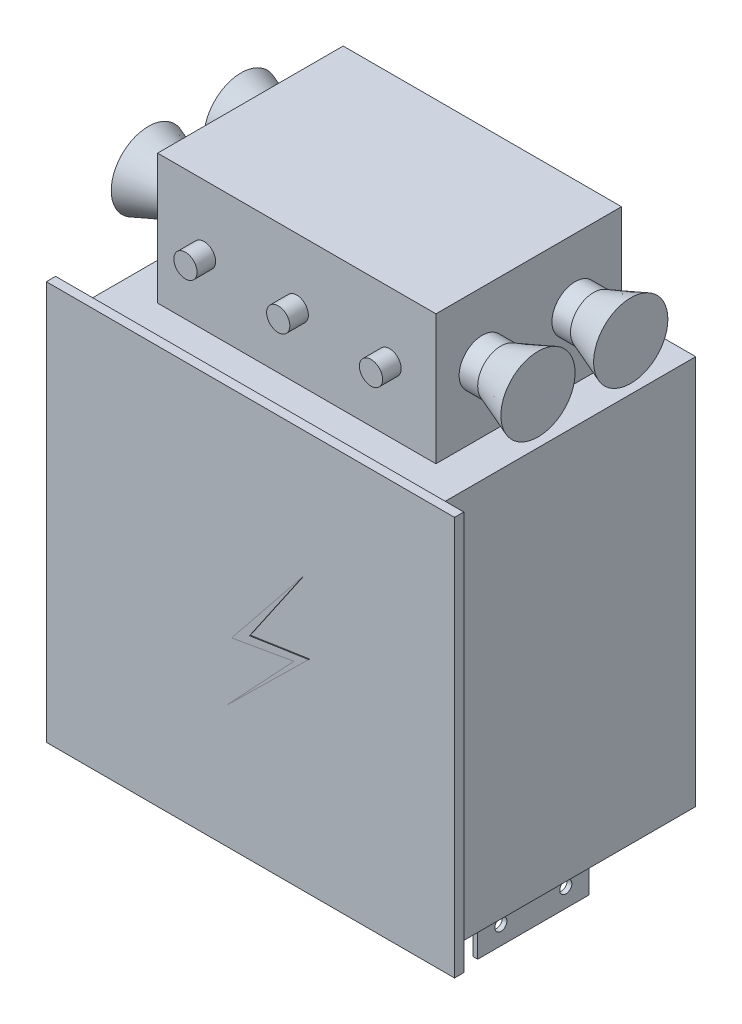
ISO-10303-21;
HEADER;
FILE_DESCRIPTION(('STEP AP214'),'2;1');
FILE_NAME('part.step','',(''),(''),'','','');
FILE_SCHEMA(('AUTOMOTIVE_DESIGN { 1 0 10303 214 1 1 1 1 }'));
ENDSEC;
DATA;
#1=APPLICATION_CONTEXT('core data for automotive mechanical design processes');
#2=APPLICATION_PROTOCOL_DEFINITION('international standard','automotive_design',2000,#1);
#3=PRODUCT_CONTEXT('',#1,'mechanical');
#4=PRODUCT('Part','Part','',(#3));
#5=PRODUCT_RELATED_PRODUCT_CATEGORY('part','',(#4));
#6=PRODUCT_DEFINITION_FORMATION('','',#4);
#7=PRODUCT_DEFINITION_CONTEXT('part definition',#1,'design');
#8=PRODUCT_DEFINITION('design','',#6,#7);
#9=PRODUCT_DEFINITION_SHAPE('','',#8);
#10=(LENGTH_UNIT() NAMED_UNIT(*) SI_UNIT(.MILLI.,.METRE.));
#11=(NAMED_UNIT(*) PLANE_ANGLE_UNIT() SI_UNIT($,.RADIAN.));
#12=(NAMED_UNIT(*) SI_UNIT($,.STERADIAN.) SOLID_ANGLE_UNIT());
#13=UNCERTAINTY_MEASURE_WITH_UNIT(LENGTH_MEASURE(1.E-05),#10,'distance_accuracy_value','');
#14=(GEOMETRIC_REPRESENTATION_CONTEXT(3) GLOBAL_UNCERTAINTY_ASSIGNED_CONTEXT((#13)) GLOBAL_UNIT_ASSIGNED_CONTEXT((#10,
#11,#12)) REPRESENTATION_CONTEXT('',''));
#15=CARTESIAN_POINT('',(0.,0.,0.));
#16=DIRECTION('',(0.,0.,1.));
#17=DIRECTION('',(1.,0.,0.));
#18=AXIS2_PLACEMENT_3D('',#15,#16,#17);
#19=CARTESIAN_POINT('',(-165.,-260.,70.));
#20=DIRECTION('',(-1.,0.,0.));
#21=DIRECTION('',(0.,0.,1.));
#22=AXIS2_PLACEMENT_3D('',#19,#20,#21);
#23=PLANE('',#22);
#24=CARTESIAN_POINT('',(-165.,-240.,45.));
#25=DIRECTION('',(1.,0.,0.));
#26=DIRECTION('',(0.,0.,-1.));
#27=AXIS2_PLACEMENT_3D('',#24,#25,#26);
#28=CIRCLE('',#27,6.5);
#29=CARTESIAN_POINT('',(-165.,-240.,38.5));
#30=VERTEX_POINT('',#29);
#31=EDGE_CURVE('E529',#30,#30,#28,.T.);
#32=ORIENTED_EDGE('',*,*,#31,.T.);
#33=EDGE_LOOP('',(#32));
#34=FACE_BOUND('',#33,.T.);
#35=DIRECTION('',(0.,0.,1.));
#36=VECTOR('',#35,1.);
#37=CARTESIAN_POINT('',(-165.,-210.,70.));
#38=LINE('',#37,#36);
#39=CARTESIAN_POINT('',(-165.,-210.,-50.));
#40=VERTEX_POINT('',#39);
#41=CARTESIAN_POINT('',(-165.,-210.,70.));
#42=VERTEX_POINT('',#41);
#43=EDGE_CURVE('E234',#40,#42,#38,.T.);
#44=ORIENTED_EDGE('',*,*,#43,.F.);
#45=DIRECTION('',(0.,1.,0.));
#46=VECTOR('',#45,1.);
#47=CARTESIAN_POINT('',(-165.,-260.,-50.));
#48=LINE('',#47,#46);
#49=CARTESIAN_POINT('',(-165.,-260.,-50.));
#50=VERTEX_POINT('',#49);
#51=EDGE_CURVE('E220',#50,#40,#48,.T.);
#52=ORIENTED_EDGE('',*,*,#51,.F.);
#53=DIRECTION('',(0.,0.,1.));
#54=VECTOR('',#53,1.);
#55=CARTESIAN_POINT('',(-165.,-260.,70.));
#56=LINE('',#55,#54);
#57=CARTESIAN_POINT('',(-165.,-260.,70.));
#58=VERTEX_POINT('',#57);
#59=EDGE_CURVE('E250',#50,#58,#56,.T.);
#60=ORIENTED_EDGE('',*,*,#59,.T.);
#61=DIRECTION('',(0.,1.,0.));
#62=VECTOR('',#61,1.);
#63=CARTESIAN_POINT('',(-165.,-260.,70.));
#64=LINE('',#63,#62);
#65=EDGE_CURVE('E236',#58,#42,#64,.T.);
#66=ORIENTED_EDGE('',*,*,#65,.T.);
#67=EDGE_LOOP('',(#44,#52,#60,#66));
#68=FACE_BOUND('',#67,.T.);
#69=CARTESIAN_POINT('',(-165.,-240.,-25.));
#70=DIRECTION('',(1.,0.,0.));
#71=DIRECTION('',(0.,0.,-1.));
#72=AXIS2_PLACEMENT_3D('',#69,#70,#71);
#73=CIRCLE('',#72,6.5);
#74=CARTESIAN_POINT('',(-165.,-240.,-31.5));
#75=VERTEX_POINT('',#74);
#76=EDGE_CURVE('E536',#75,#75,#73,.T.);
#77=ORIENTED_EDGE('',*,*,#76,.T.);
#78=EDGE_LOOP('',(#77));
#79=FACE_BOUND('',#78,.T.);
#80=ADVANCED_FACE('F45',(#34,#68,#79),#23,.T.);
#81=CARTESIAN_POINT('',(-160.,-260.,70.));
#82=DIRECTION('',(1.,0.,0.));
#83=DIRECTION('',(0.,0.,-1.));
#84=AXIS2_PLACEMENT_3D('',#81,#82,#83);
#85=PLANE('',#84);
#86=CARTESIAN_POINT('',(-160.,-240.,45.));
#87=DIRECTION('',(1.,0.,0.));
#88=DIRECTION('',(0.,0.,-1.));
#89=AXIS2_PLACEMENT_3D('',#86,#87,#88);
#90=CIRCLE('',#89,6.5);
#91=CARTESIAN_POINT('',(-160.,-240.,38.5));
#92=VERTEX_POINT('',#91);
#93=EDGE_CURVE('E240',#92,#92,#90,.F.);
#94=ORIENTED_EDGE('',*,*,#93,.T.);
#95=EDGE_LOOP('',(#94));
#96=FACE_BOUND('',#95,.T.);
#97=DIRECTION('',(0.,0.,-1.));
#98=VECTOR('',#97,1.);
#99=CARTESIAN_POINT('',(-160.,-210.,70.));
#100=LINE('',#99,#98);
#101=CARTESIAN_POINT('',(-160.,-210.,70.));
#102=VERTEX_POINT('',#101);
#103=CARTESIAN_POINT('',(-160.,-210.,-50.));
#104=VERTEX_POINT('',#103);
#105=EDGE_CURVE('E62',#102,#104,#100,.T.);
#106=ORIENTED_EDGE('',*,*,#105,.F.);
#107=DIRECTION('',(0.,1.,0.));
#108=VECTOR('',#107,1.);
#109=CARTESIAN_POINT('',(-160.,-260.,70.));
#110=LINE('',#109,#108);
#111=CARTESIAN_POINT('',(-160.,-260.,70.));
#112=VERTEX_POINT('',#111);
#113=EDGE_CURVE('E260',#112,#102,#110,.T.);
#114=ORIENTED_EDGE('',*,*,#113,.F.);
#115=DIRECTION('',(0.,0.,-1.));
#116=VECTOR('',#115,1.);
#117=CARTESIAN_POINT('',(-160.,-260.,70.));
#118=LINE('',#117,#116);
#119=CARTESIAN_POINT('',(-160.,-260.,-50.));
#120=VERTEX_POINT('',#119);
#121=EDGE_CURVE('E253',#112,#120,#118,.T.);
#122=ORIENTED_EDGE('',*,*,#121,.T.);
#123=DIRECTION('',(0.,1.,0.));
#124=VECTOR('',#123,1.);
#125=CARTESIAN_POINT('',(-160.,-260.,-50.));
#126=LINE('',#125,#124);
#127=EDGE_CURVE('E231',#120,#104,#126,.T.);
#128=ORIENTED_EDGE('',*,*,#127,.T.);
#129=EDGE_LOOP('',(#106,#114,#122,#128));
#130=FACE_BOUND('',#129,.T.);
#131=CARTESIAN_POINT('',(-160.,-240.,-25.));
#132=DIRECTION('',(1.,0.,0.));
#133=DIRECTION('',(0.,0.,-1.));
#134=AXIS2_PLACEMENT_3D('',#131,#132,#133);
#135=CIRCLE('',#134,6.5);
#136=CARTESIAN_POINT('',(-160.,-240.,-31.5));
#137=VERTEX_POINT('',#136);
#138=EDGE_CURVE('E49',#137,#137,#135,.F.);
#139=ORIENTED_EDGE('',*,*,#138,.T.);
#140=EDGE_LOOP('',(#139));
#141=FACE_BOUND('',#140,.T.);
#142=ADVANCED_FACE('F554',(#96,#130,#141),#85,.T.);
#143=CARTESIAN_POINT('',(-190.,-210.,140.));
#144=DIRECTION('',(0.,1.,0.));
#145=DIRECTION('',(0.,0.,1.));
#146=AXIS2_PLACEMENT_3D('',#143,#144,#145);
#147=PLANE('',#146);
#148=DIRECTION('',(-1.,0.,0.));
#149=VECTOR('',#148,1.);
#150=CARTESIAN_POINT('',(-165.,-210.,-50.));
#151=LINE('',#150,#149);
#152=EDGE_CURVE('E224',#104,#40,#151,.T.);
#153=ORIENTED_EDGE('',*,*,#152,.T.);
#154=ORIENTED_EDGE('',*,*,#43,.T.);
#155=DIRECTION('',(1.,0.,0.));
#156=VECTOR('',#155,1.);
#157=CARTESIAN_POINT('',(-165.,-210.,70.));
#158=LINE('',#157,#156);
#159=EDGE_CURVE('E245',#42,#102,#158,.T.);
#160=ORIENTED_EDGE('',*,*,#159,.T.);
#161=ORIENTED_EDGE('',*,*,#105,.T.);
#162=EDGE_LOOP('',(#153,#154,#160,#161));
#163=FACE_BOUND('',#162,.T.);
#164=DIRECTION('',(1.,0.,0.));
#165=VECTOR('',#164,1.);
#166=CARTESIAN_POINT('',(-190.,-210.,-140.));
#167=LINE('',#166,#165);
#168=CARTESIAN_POINT('',(-190.,-210.,-140.));
#169=VERTEX_POINT('',#168);
#170=CARTESIAN_POINT('',(190.,-210.,-140.));
#171=VERTEX_POINT('',#170);
#172=EDGE_CURVE('E1209',#169,#171,#167,.T.);
#173=ORIENTED_EDGE('',*,*,#172,.T.);
#174=DIRECTION('',(0.,0.,-1.));
#175=VECTOR('',#174,1.);
#176=CARTESIAN_POINT('',(190.,-210.,140.));
#177=LINE('',#176,#175);
#178=CARTESIAN_POINT('',(190.,-210.,140.));
#179=VERTEX_POINT('',#178);
#180=EDGE_CURVE('E471',#179,#171,#177,.T.);
#181=ORIENTED_EDGE('',*,*,#180,.F.);
#182=DIRECTION('',(1.,0.,0.));
#183=VECTOR('',#182,1.);
#184=CARTESIAN_POINT('',(-220.,-210.,140.));
#185=LINE('',#184,#183);
#186=CARTESIAN_POINT('',(220.,-210.,140.));
#187=VERTEX_POINT('',#186);
#188=EDGE_CURVE('E412',#179,#187,#185,.T.);
#189=ORIENTED_EDGE('',*,*,#188,.T.);
#190=DIRECTION('',(0.,0.,-1.));
#191=VECTOR('',#190,1.);
#192=CARTESIAN_POINT('',(220.,-210.,150.));
#193=LINE('',#192,#191);
#194=CARTESIAN_POINT('',(220.,-210.,150.));
#195=VERTEX_POINT('',#194);
#196=EDGE_CURVE('E428',#195,#187,#193,.T.);
#197=ORIENTED_EDGE('',*,*,#196,.F.);
#198=DIRECTION('',(1.,0.,0.));
#199=VECTOR('',#198,1.);
#200=CARTESIAN_POINT('',(-220.,-210.,150.));
#201=LINE('',#200,#199);
#202=CARTESIAN_POINT('',(-220.,-210.,150.));
#203=VERTEX_POINT('',#202);
#204=EDGE_CURVE('E441',#203,#195,#201,.T.);
#205=ORIENTED_EDGE('',*,*,#204,.F.);
#206=DIRECTION('',(0.,0.,-1.));
#207=VECTOR('',#206,1.);
#208=CARTESIAN_POINT('',(-220.,-210.,150.));
#209=LINE('',#208,#207);
#210=CARTESIAN_POINT('',(-220.,-210.,140.));
#211=VERTEX_POINT('',#210);
#212=EDGE_CURVE('E424',#203,#211,#209,.T.);
#213=ORIENTED_EDGE('',*,*,#212,.T.);
#214=CARTESIAN_POINT('',(-190.,-210.,140.));
#215=VERTEX_POINT('',#214);
#216=EDGE_CURVE('E421',#211,#215,#185,.T.);
#217=ORIENTED_EDGE('',*,*,#216,.T.);
#218=DIRECTION('',(0.,0.,-1.));
#219=VECTOR('',#218,1.);
#220=CARTESIAN_POINT('',(-190.,-210.,140.));
#221=LINE('',#220,#219);
#222=EDGE_CURVE('E491',#215,#169,#221,.T.);
#223=ORIENTED_EDGE('',*,*,#222,.T.);
#224=EDGE_LOOP('',(#173,#181,#189,#197,#205,#213,#217,#223));
#225=FACE_BOUND('',#224,.T.);
#226=DIRECTION('',(0.,0.,1.));
#227=VECTOR('',#226,1.);
#228=CARTESIAN_POINT('',(165.,-210.,70.));
#229=LINE('',#228,#227);
#230=CARTESIAN_POINT('',(165.,-210.,-50.));
#231=VERTEX_POINT('',#230);
#232=CARTESIAN_POINT('',(165.,-210.,70.));
#233=VERTEX_POINT('',#232);
#234=EDGE_CURVE('E270',#231,#233,#229,.T.);
#235=ORIENTED_EDGE('',*,*,#234,.F.);
#236=DIRECTION('',(1.,0.,0.));
#237=VECTOR('',#236,1.);
#238=CARTESIAN_POINT('',(165.,-210.,-50.));
#239=LINE('',#238,#237);
#240=CARTESIAN_POINT('',(160.,-210.,-50.));
#241=VERTEX_POINT('',#240);
#242=EDGE_CURVE('E277',#241,#231,#239,.T.);
#243=ORIENTED_EDGE('',*,*,#242,.F.);
#244=DIRECTION('',(0.,0.,-1.));
#245=VECTOR('',#244,1.);
#246=CARTESIAN_POINT('',(160.,-210.,70.));
#247=LINE('',#246,#245);
#248=CARTESIAN_POINT('',(160.,-210.,70.));
#249=VERTEX_POINT('',#248);
#250=EDGE_CURVE('E274',#249,#241,#247,.T.);
#251=ORIENTED_EDGE('',*,*,#250,.F.);
#252=DIRECTION('',(-1.,0.,0.));
#253=VECTOR('',#252,1.);
#254=CARTESIAN_POINT('',(165.,-210.,70.));
#255=LINE('',#254,#253);
#256=EDGE_CURVE('E70',#233,#249,#255,.T.);
#257=ORIENTED_EDGE('',*,*,#256,.F.);
#258=EDGE_LOOP('',(#235,#243,#251,#257));
#259=FACE_BOUND('',#258,.T.);
#260=ADVANCED_FACE('F242',(#163,#225,#259),#147,.F.);
#261=CARTESIAN_POINT('',(150.,350.,100.));
#262=DIRECTION('',(0.,0.,-1.));
#263=DIRECTION('',(-1.,0.,0.));
#264=AXIS2_PLACEMENT_3D('',#261,#262,#263);
#265=PLANE('',#264);
#266=CARTESIAN_POINT('',(0.,280.,100.));
#267=DIRECTION('',(0.,0.,-1.));
#268=DIRECTION('',(-1.,0.,0.));
#269=AXIS2_PLACEMENT_3D('',#266,#267,#268);
#270=CIRCLE('',#269,12.5);
#271=CARTESIAN_POINT('',(-12.5,280.,100.));
#272=VERTEX_POINT('',#271);
#273=EDGE_CURVE('E54',#272,#272,#270,.F.);
#274=ORIENTED_EDGE('',*,*,#273,.F.);
#275=EDGE_LOOP('',(#274));
#276=FACE_BOUND('',#275,.T.);
#277=DIRECTION('',(1.,0.,0.));
#278=VECTOR('',#277,1.);
#279=CARTESIAN_POINT('',(150.,210.,100.));
#280=LINE('',#279,#278);
#281=CARTESIAN_POINT('',(-150.,210.,100.));
#282=VERTEX_POINT('',#281);
#283=CARTESIAN_POINT('',(150.,210.,100.));
#284=VERTEX_POINT('',#283);
#285=EDGE_CURVE('E385',#282,#284,#280,.T.);
#286=ORIENTED_EDGE('',*,*,#285,.T.);
#287=DIRECTION('',(0.,-1.,0.));
#288=VECTOR('',#287,1.);
#289=CARTESIAN_POINT('',(150.,350.,100.));
#290=LINE('',#289,#288);
#291=CARTESIAN_POINT('',(150.,350.,100.));
#292=VERTEX_POINT('',#291);
#293=EDGE_CURVE('E397',#292,#284,#290,.T.);
#294=ORIENTED_EDGE('',*,*,#293,.F.);
#295=DIRECTION('',(1.,0.,0.));
#296=VECTOR('',#295,1.);
#297=CARTESIAN_POINT('',(150.,350.,100.));
#298=LINE('',#297,#296);
#299=CARTESIAN_POINT('',(-150.,350.,100.));
#300=VERTEX_POINT('',#299);
#301=EDGE_CURVE('E395',#300,#292,#298,.T.);
#302=ORIENTED_EDGE('',*,*,#301,.F.);
#303=DIRECTION('',(0.,-1.,0.));
#304=VECTOR('',#303,1.);
#305=CARTESIAN_POINT('',(-150.,350.,100.));
#306=LINE('',#305,#304);
#307=EDGE_CURVE('E400',#300,#282,#306,.T.);
#308=ORIENTED_EDGE('',*,*,#307,.T.);
#309=EDGE_LOOP('',(#286,#294,#302,#308));
#310=FACE_BOUND('',#309,.T.);
#311=CARTESIAN_POINT('',(-100.,280.,100.));
#312=DIRECTION('',(0.,0.,-1.));
#313=DIRECTION('',(-1.,0.,0.));
#314=AXIS2_PLACEMENT_3D('',#311,#312,#313);
#315=CIRCLE('',#314,12.5);
#316=CARTESIAN_POINT('',(-112.5,280.,100.));
#317=VERTEX_POINT('',#316);
#318=EDGE_CURVE('E520',#317,#317,#315,.F.);
#319=ORIENTED_EDGE('',*,*,#318,.F.);
#320=EDGE_LOOP('',(#319));
#321=FACE_BOUND('',#320,.T.);
#322=CARTESIAN_POINT('',(100.,280.,100.));
#323=DIRECTION('',(0.,0.,-1.));
#324=DIRECTION('',(-1.,0.,0.));
#325=AXIS2_PLACEMENT_3D('',#322,#323,#324);
#326=CIRCLE('',#325,12.5);
#327=CARTESIAN_POINT('',(87.5,280.,100.));
#328=VERTEX_POINT('',#327);
#329=EDGE_CURVE('E11',#328,#328,#326,.F.);
#330=ORIENTED_EDGE('',*,*,#329,.F.);
#331=EDGE_LOOP('',(#330));
#332=FACE_BOUND('',#331,.T.);
#333=ADVANCED_FACE('F694',(#276,#310,#321,#332),#265,.F.);
#334=CARTESIAN_POINT('',(-150.,350.,100.));
#335=DIRECTION('',(1.,0.,0.));
#336=DIRECTION('',(0.,1.,0.));
#337=AXIS2_PLACEMENT_3D('',#334,#335,#336);
#338=PLANE('',#337);
#339=CARTESIAN_POINT('',(-150.,280.,-50.));
#340=DIRECTION('',(1.,0.,0.));
#341=DIRECTION('',(0.,1.,0.));
#342=AXIS2_PLACEMENT_3D('',#339,#340,#341);
#343=CIRCLE('',#342,25.);
#344=CARTESIAN_POINT('',(-150.,305.,-50.));
#345=VERTEX_POINT('',#344);
#346=EDGE_CURVE('E511',#345,#345,#343,.F.);
#347=ORIENTED_EDGE('',*,*,#346,.F.);
#348=EDGE_LOOP('',(#347));
#349=FACE_BOUND('',#348,.T.);
#350=DIRECTION('',(0.,0.,1.));
#351=VECTOR('',#350,1.);
#352=CARTESIAN_POINT('',(-150.,210.,100.));
#353=LINE('',#352,#351);
#354=CARTESIAN_POINT('',(-150.,210.,-100.));
#355=VERTEX_POINT('',#354);
#356=EDGE_CURVE('E382',#355,#282,#353,.T.);
#357=ORIENTED_EDGE('',*,*,#356,.T.);
#358=ORIENTED_EDGE('',*,*,#307,.F.);
#359=DIRECTION('',(0.,0.,1.));
#360=VECTOR('',#359,1.);
#361=CARTESIAN_POINT('',(-150.,350.,100.));
#362=LINE('',#361,#360);
#363=CARTESIAN_POINT('',(-150.,350.,-100.));
#364=VERTEX_POINT('',#363);
#365=EDGE_CURVE('E393',#364,#300,#362,.T.);
#366=ORIENTED_EDGE('',*,*,#365,.F.);
#367=DIRECTION('',(0.,-1.,0.));
#368=VECTOR('',#367,1.);
#369=CARTESIAN_POINT('',(-150.,350.,-100.));
#370=LINE('',#369,#368);
#371=EDGE_CURVE('E403',#364,#355,#370,.T.);
#372=ORIENTED_EDGE('',*,*,#371,.T.);
#373=EDGE_LOOP('',(#357,#358,#366,#372));
#374=FACE_BOUND('',#373,.T.);
#375=CARTESIAN_POINT('',(-150.,280.,50.));
#376=DIRECTION('',(1.,0.,0.));
#377=DIRECTION('',(0.,1.,0.));
#378=AXIS2_PLACEMENT_3D('',#375,#376,#377);
#379=CIRCLE('',#378,25.);
#380=CARTESIAN_POINT('',(-150.,305.,50.));
#381=VERTEX_POINT('',#380);
#382=EDGE_CURVE('E517',#381,#381,#379,.F.);
#383=ORIENTED_EDGE('',*,*,#382,.F.);
#384=EDGE_LOOP('',(#383));
#385=FACE_BOUND('',#384,.T.);
#386=ADVANCED_FACE('F697',(#349,#374,#385),#338,.F.);
#387=CARTESIAN_POINT('',(150.,350.,100.));
#388=DIRECTION('',(-1.,0.,0.));
#389=DIRECTION('',(0.,0.,1.));
#390=AXIS2_PLACEMENT_3D('',#387,#388,#389);
#391=PLANE('',#390);
#392=CARTESIAN_POINT('',(150.,280.,50.));
#393=DIRECTION('',(-1.,0.,0.));
#394=DIRECTION('',(0.,0.,1.));
#395=AXIS2_PLACEMENT_3D('',#392,#393,#394);
#396=CIRCLE('',#395,25.);
#397=CARTESIAN_POINT('',(150.,280.,75.));
#398=VERTEX_POINT('',#397);
#399=EDGE_CURVE('E503',#398,#398,#396,.F.);
#400=ORIENTED_EDGE('',*,*,#399,.F.);
#401=EDGE_LOOP('',(#400));
#402=FACE_BOUND('',#401,.T.);
#403=DIRECTION('',(0.,0.,-1.));
#404=VECTOR('',#403,1.);
#405=CARTESIAN_POINT('',(150.,210.,100.));
#406=LINE('',#405,#404);
#407=CARTESIAN_POINT('',(150.,210.,-100.));
#408=VERTEX_POINT('',#407);
#409=EDGE_CURVE('E376',#284,#408,#406,.T.);
#410=ORIENTED_EDGE('',*,*,#409,.T.);
#411=DIRECTION('',(0.,-1.,0.));
#412=VECTOR('',#411,1.);
#413=CARTESIAN_POINT('',(150.,350.,-100.));
#414=LINE('',#413,#412);
#415=CARTESIAN_POINT('',(150.,350.,-100.));
#416=VERTEX_POINT('',#415);
#417=EDGE_CURVE('E406',#416,#408,#414,.T.);
#418=ORIENTED_EDGE('',*,*,#417,.F.);
#419=DIRECTION('',(0.,0.,-1.));
#420=VECTOR('',#419,1.);
#421=CARTESIAN_POINT('',(150.,350.,100.));
#422=LINE('',#421,#420);
#423=EDGE_CURVE('E388',#292,#416,#422,.T.);
#424=ORIENTED_EDGE('',*,*,#423,.F.);
#425=ORIENTED_EDGE('',*,*,#293,.T.);
#426=EDGE_LOOP('',(#410,#418,#424,#425));
#427=FACE_BOUND('',#426,.T.);
#428=CARTESIAN_POINT('',(150.,280.,-50.));
#429=DIRECTION('',(-1.,0.,0.));
#430=DIRECTION('',(0.,0.,1.));
#431=AXIS2_PLACEMENT_3D('',#428,#429,#430);
#432=CIRCLE('',#431,25.);
#433=CARTESIAN_POINT('',(150.,280.,-25.));
#434=VERTEX_POINT('',#433);
#435=EDGE_CURVE('E506',#434,#434,#432,.F.);
#436=ORIENTED_EDGE('',*,*,#435,.F.);
#437=EDGE_LOOP('',(#436));
#438=FACE_BOUND('',#437,.T.);
#439=ADVANCED_FACE('F701',(#402,#427,#438),#391,.F.);
#440=CARTESIAN_POINT('',(-220.,-210.,150.));
#441=DIRECTION('',(0.,0.,1.));
#442=DIRECTION('',(1.,0.,0.));
#443=AXIS2_PLACEMENT_3D('',#440,#441,#442);
#444=PLANE('',#443);
#445=DIRECTION('',(0.,-1.,0.));
#446=VECTOR('',#445,1.);
#447=CARTESIAN_POINT('',(-220.,220.,150.));
#448=LINE('',#447,#446);
#449=CARTESIAN_POINT('',(-220.,220.,150.));
#450=VERTEX_POINT('',#449);
#451=EDGE_CURVE('E443',#450,#203,#448,.T.);
#452=ORIENTED_EDGE('',*,*,#451,.T.);
#453=ORIENTED_EDGE('',*,*,#204,.T.);
#454=DIRECTION('',(0.,1.,0.));
#455=VECTOR('',#454,1.);
#456=CARTESIAN_POINT('',(220.,220.,150.));
#457=LINE('',#456,#455);
#458=CARTESIAN_POINT('',(220.,220.,150.));
#459=VERTEX_POINT('',#458);
#460=EDGE_CURVE('E439',#195,#459,#457,.T.);
#461=ORIENTED_EDGE('',*,*,#460,.T.);
#462=DIRECTION('',(-1.,0.,0.));
#463=VECTOR('',#462,1.);
#464=CARTESIAN_POINT('',(-220.,220.,150.));
#465=LINE('',#464,#463);
#466=EDGE_CURVE('E437',#459,#450,#465,.T.);
#467=ORIENTED_EDGE('',*,*,#466,.T.);
#468=EDGE_LOOP('',(#452,#453,#461,#467));
#469=FACE_BOUND('',#468,.T.);
#470=DIRECTION('',(0.985327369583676,0.170675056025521,0.));
#471=VECTOR('',#470,1.);
#472=CARTESIAN_POINT('',(-19.2264789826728,-11.6076890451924,150.));
#473=LINE('',#472,#471);
#474=CARTESIAN_POINT('',(-19.2264789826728,-11.6076890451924,150.));
#475=VERTEX_POINT('',#474);
#476=CARTESIAN_POINT('',(47.7860885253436,0.,150.));
#477=VERTEX_POINT('',#476);
#478=EDGE_CURVE('E336',#475,#477,#473,.T.);
#479=ORIENTED_EDGE('',*,*,#478,.F.);
#480=DIRECTION('',(-0.626284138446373,-0.779594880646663,0.));
#481=VECTOR('',#480,1.);
#482=CARTESIAN_POINT('',(57.6464263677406,84.0832598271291,150.));
#483=LINE('',#482,#481);
#484=CARTESIAN_POINT('',(57.6464263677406,84.0832598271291,150.));
#485=VERTEX_POINT('',#484);
#486=EDGE_CURVE('E333',#485,#475,#483,.T.);
#487=ORIENTED_EDGE('',*,*,#486,.F.);
#488=DIRECTION('',(0.565457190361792,0.824777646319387,0.));
#489=VECTOR('',#488,1.);
#490=CARTESIAN_POINT('',(57.6464263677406,84.0832598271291,150.));
#491=LINE('',#490,#489);
#492=CARTESIAN_POINT('',(0.,0.,150.));
#493=VERTEX_POINT('',#492);
#494=EDGE_CURVE('E345',#493,#485,#491,.T.);
#495=ORIENTED_EDGE('',*,*,#494,.F.);
#496=DIRECTION('',(-0.988751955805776,-0.149564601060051,0.));
#497=VECTOR('',#496,1.);
#498=CARTESIAN_POINT('',(0.,0.,150.));
#499=LINE('',#498,#497);
#500=CARTESIAN_POINT('',(63.8389413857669,9.65666438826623,150.));
#501=VERTEX_POINT('',#500);
#502=EDGE_CURVE('E342',#501,#493,#499,.T.);
#503=ORIENTED_EDGE('',*,*,#502,.F.);
#504=DIRECTION('',(0.713542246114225,0.700612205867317,0.));
#505=VECTOR('',#504,1.);
#506=CARTESIAN_POINT('',(63.8389413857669,9.65666438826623,150.));
#507=LINE('',#506,#505);
#508=CARTESIAN_POINT('',(-25.0250472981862,-77.5970272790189,150.));
#509=VERTEX_POINT('',#508);
#510=EDGE_CURVE('E340',#509,#501,#507,.T.);
#511=ORIENTED_EDGE('',*,*,#510,.F.);
#512=DIRECTION('',(-0.684260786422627,-0.729237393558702,0.));
#513=VECTOR('',#512,1.);
#514=CARTESIAN_POINT('',(47.7860885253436,0.,150.));
#515=LINE('',#514,#513);
#516=EDGE_CURVE('E338',#477,#509,#515,.T.);
#517=ORIENTED_EDGE('',*,*,#516,.F.);
#518=EDGE_LOOP('',(#479,#487,#495,#503,#511,#517));
#519=FACE_BOUND('',#518,.T.);
#520=ADVANCED_FACE('F468',(#469,#519),#444,.T.);
#521=CARTESIAN_POINT('',(-190.,210.,140.));
#522=DIRECTION('',(0.,-1.,0.));
#523=DIRECTION('',(1.,0.,0.));
#524=AXIS2_PLACEMENT_3D('',#521,#522,#523);
#525=PLANE('',#524);
#526=DIRECTION('',(-1.,0.,0.));
#527=VECTOR('',#526,1.);
#528=CARTESIAN_POINT('',(-190.,210.,-140.));
#529=LINE('',#528,#527);
#530=CARTESIAN_POINT('',(190.,210.,-140.));
#531=VERTEX_POINT('',#530);
#532=CARTESIAN_POINT('',(-190.,210.,-140.));
#533=VERTEX_POINT('',#532);
#534=EDGE_CURVE('E482',#531,#533,#529,.T.);
#535=ORIENTED_EDGE('',*,*,#534,.T.);
#536=DIRECTION('',(0.,0.,-1.));
#537=VECTOR('',#536,1.);
#538=CARTESIAN_POINT('',(-190.,210.,140.));
#539=LINE('',#538,#537);
#540=CARTESIAN_POINT('',(-190.,210.,140.));
#541=VERTEX_POINT('',#540);
#542=EDGE_CURVE('E480',#541,#533,#539,.T.);
#543=ORIENTED_EDGE('',*,*,#542,.F.);
#544=DIRECTION('',(-1.,0.,0.));
#545=VECTOR('',#544,1.);
#546=CARTESIAN_POINT('',(-190.,210.,140.));
#547=LINE('',#546,#545);
#548=CARTESIAN_POINT('',(190.,210.,140.));
#549=VERTEX_POINT('',#548);
#550=EDGE_CURVE('E476',#549,#541,#547,.T.);
#551=ORIENTED_EDGE('',*,*,#550,.F.);
#552=DIRECTION('',(0.,0.,-1.));
#553=VECTOR('',#552,1.);
#554=CARTESIAN_POINT('',(190.,210.,140.));
#555=LINE('',#554,#553);
#556=EDGE_CURVE('E499',#549,#531,#555,.T.);
#557=ORIENTED_EDGE('',*,*,#556,.T.);
#558=EDGE_LOOP('',(#535,#543,#551,#557));
#559=FACE_BOUND('',#558,.T.);
#560=ORIENTED_EDGE('',*,*,#409,.F.);
#561=ORIENTED_EDGE('',*,*,#285,.F.);
#562=ORIENTED_EDGE('',*,*,#356,.F.);
#563=DIRECTION('',(-1.,0.,0.));
#564=VECTOR('',#563,1.);
#565=CARTESIAN_POINT('',(150.,210.,-100.));
#566=LINE('',#565,#564);
#567=EDGE_CURVE('E379',#408,#355,#566,.T.);
#568=ORIENTED_EDGE('',*,*,#567,.F.);
#569=EDGE_LOOP('',(#560,#561,#562,#568));
#570=FACE_BOUND('',#569,.T.);
#571=ADVANCED_FACE('F714',(#559,#570),#525,.F.);
#572=CARTESIAN_POINT('',(-190.,210.,140.));
#573=DIRECTION('',(1.,0.,0.));
#574=DIRECTION('',(0.,1.,0.));
#575=AXIS2_PLACEMENT_3D('',#572,#573,#574);
#576=PLANE('',#575);
#577=DIRECTION('',(0.,-1.,0.));
#578=VECTOR('',#577,1.);
#579=CARTESIAN_POINT('',(-190.,210.,-140.));
#580=LINE('',#579,#578);
#581=EDGE_CURVE('E427',#533,#169,#580,.T.);
#582=ORIENTED_EDGE('',*,*,#581,.T.);
#583=ORIENTED_EDGE('',*,*,#222,.F.);
#584=DIRECTION('',(0.,-1.,0.));
#585=VECTOR('',#584,1.);
#586=CARTESIAN_POINT('',(-190.,210.,140.));
#587=LINE('',#586,#585);
#588=EDGE_CURVE('E478',#541,#215,#587,.T.);
#589=ORIENTED_EDGE('',*,*,#588,.F.);
#590=ORIENTED_EDGE('',*,*,#542,.T.);
#591=EDGE_LOOP('',(#582,#583,#589,#590));
#592=FACE_BOUND('',#591,.T.);
#593=ADVANCED_FACE('F47',(#592),#576,.F.);
#594=CARTESIAN_POINT('',(190.,210.,140.));
#595=DIRECTION('',(-1.,0.,0.));
#596=DIRECTION('',(0.,-1.,0.));
#597=AXIS2_PLACEMENT_3D('',#594,#595,#596);
#598=PLANE('',#597);
#599=DIRECTION('',(0.,1.,0.));
#600=VECTOR('',#599,1.);
#601=CARTESIAN_POINT('',(190.,210.,-140.));
#602=LINE('',#601,#600);
#603=EDGE_CURVE('E1210',#171,#531,#602,.T.);
#604=ORIENTED_EDGE('',*,*,#603,.T.);
#605=ORIENTED_EDGE('',*,*,#556,.F.);
#606=DIRECTION('',(0.,1.,0.));
#607=VECTOR('',#606,1.);
#608=CARTESIAN_POINT('',(190.,210.,140.));
#609=LINE('',#608,#607);
#610=EDGE_CURVE('E474',#179,#549,#609,.T.);
#611=ORIENTED_EDGE('',*,*,#610,.F.);
#612=ORIENTED_EDGE('',*,*,#180,.T.);
#613=EDGE_LOOP('',(#604,#605,#611,#612));
#614=FACE_BOUND('',#613,.T.);
#615=ADVANCED_FACE('F723',(#614),#598,.F.);
#616=CARTESIAN_POINT('',(-190.,-210.,-140.));
#617=DIRECTION('',(0.,0.,1.));
#618=DIRECTION('',(1.,0.,0.));
#619=AXIS2_PLACEMENT_3D('',#616,#617,#618);
#620=PLANE('',#619);
#621=ORIENTED_EDGE('',*,*,#581,.F.);
#622=ORIENTED_EDGE('',*,*,#534,.F.);
#623=ORIENTED_EDGE('',*,*,#603,.F.);
#624=ORIENTED_EDGE('',*,*,#172,.F.);
#625=EDGE_LOOP('',(#621,#622,#623,#624));
#626=FACE_BOUND('',#625,.T.);
#627=ADVANCED_FACE('F711',(#626),#620,.F.);
#628=CARTESIAN_POINT('',(-220.,-210.,140.));
#629=DIRECTION('',(0.,0.,1.));
#630=DIRECTION('',(1.,0.,0.));
#631=AXIS2_PLACEMENT_3D('',#628,#629,#630);
#632=PLANE('',#631);
#633=ORIENTED_EDGE('',*,*,#550,.T.);
#634=ORIENTED_EDGE('',*,*,#588,.T.);
#635=ORIENTED_EDGE('',*,*,#216,.F.);
#636=DIRECTION('',(0.,-1.,0.));
#637=VECTOR('',#636,1.);
#638=CARTESIAN_POINT('',(-220.,220.,140.));
#639=LINE('',#638,#637);
#640=CARTESIAN_POINT('',(-220.,220.,140.));
#641=VERTEX_POINT('',#640);
#642=EDGE_CURVE('E409',#641,#211,#639,.T.);
#643=ORIENTED_EDGE('',*,*,#642,.F.);
#644=DIRECTION('',(-1.,0.,0.));
#645=VECTOR('',#644,1.);
#646=CARTESIAN_POINT('',(-220.,220.,140.));
#647=LINE('',#646,#645);
#648=CARTESIAN_POINT('',(220.,220.,140.));
#649=VERTEX_POINT('',#648);
#650=EDGE_CURVE('E445',#649,#641,#647,.T.);
#651=ORIENTED_EDGE('',*,*,#650,.F.);
#652=DIRECTION('',(0.,1.,0.));
#653=VECTOR('',#652,1.);
#654=CARTESIAN_POINT('',(220.,220.,140.));
#655=LINE('',#654,#653);
#656=EDGE_CURVE('E415',#187,#649,#655,.T.);
#657=ORIENTED_EDGE('',*,*,#656,.F.);
#658=ORIENTED_EDGE('',*,*,#188,.F.);
#659=ORIENTED_EDGE('',*,*,#610,.T.);
#660=EDGE_LOOP('',(#633,#634,#635,#643,#651,#657,#658,#659));
#661=FACE_BOUND('',#660,.T.);
#662=ADVANCED_FACE('F461',(#661),#632,.F.);
#663=CARTESIAN_POINT('',(-220.,220.,150.));
#664=DIRECTION('',(1.,0.,0.));
#665=DIRECTION('',(0.,1.,0.));
#666=AXIS2_PLACEMENT_3D('',#663,#664,#665);
#667=PLANE('',#666);
#668=ORIENTED_EDGE('',*,*,#642,.T.);
#669=ORIENTED_EDGE('',*,*,#212,.F.);
#670=ORIENTED_EDGE('',*,*,#451,.F.);
#671=DIRECTION('',(0.,0.,-1.));
#672=VECTOR('',#671,1.);
#673=CARTESIAN_POINT('',(-220.,220.,150.));
#674=LINE('',#673,#672);
#675=EDGE_CURVE('E434',#450,#641,#674,.T.);
#676=ORIENTED_EDGE('',*,*,#675,.T.);
#677=EDGE_LOOP('',(#668,#669,#670,#676));
#678=FACE_BOUND('',#677,.T.);
#679=ADVANCED_FACE('F465',(#678),#667,.F.);
#680=CARTESIAN_POINT('',(220.,220.,150.));
#681=DIRECTION('',(-1.,0.,0.));
#682=DIRECTION('',(0.,-1.,0.));
#683=AXIS2_PLACEMENT_3D('',#680,#681,#682);
#684=PLANE('',#683);
#685=ORIENTED_EDGE('',*,*,#656,.T.);
#686=DIRECTION('',(0.,0.,-1.));
#687=VECTOR('',#686,1.);
#688=CARTESIAN_POINT('',(220.,220.,150.));
#689=LINE('',#688,#687);
#690=EDGE_CURVE('E431',#459,#649,#689,.T.);
#691=ORIENTED_EDGE('',*,*,#690,.F.);
#692=ORIENTED_EDGE('',*,*,#460,.F.);
#693=ORIENTED_EDGE('',*,*,#196,.T.);
#694=EDGE_LOOP('',(#685,#691,#692,#693));
#695=FACE_BOUND('',#694,.T.);
#696=ADVANCED_FACE('F452',(#695),#684,.F.);
#697=CARTESIAN_POINT('',(-220.,220.,150.));
#698=DIRECTION('',(0.,-1.,0.));
#699=DIRECTION('',(0.,0.,-1.));
#700=AXIS2_PLACEMENT_3D('',#697,#698,#699);
#701=PLANE('',#700);
#702=ORIENTED_EDGE('',*,*,#650,.T.);
#703=ORIENTED_EDGE('',*,*,#675,.F.);
#704=ORIENTED_EDGE('',*,*,#466,.F.);
#705=ORIENTED_EDGE('',*,*,#690,.T.);
#706=EDGE_LOOP('',(#702,#703,#704,#705));
#707=FACE_BOUND('',#706,.T.);
#708=ADVANCED_FACE('F458',(#707),#701,.F.);
#709=CARTESIAN_POINT('',(150.,350.,-100.));
#710=DIRECTION('',(0.,0.,1.));
#711=DIRECTION('',(1.,0.,0.));
#712=AXIS2_PLACEMENT_3D('',#709,#710,#711);
#713=PLANE('',#712);
#714=ORIENTED_EDGE('',*,*,#567,.T.);
#715=ORIENTED_EDGE('',*,*,#371,.F.);
#716=DIRECTION('',(-1.,0.,0.));
#717=VECTOR('',#716,1.);
#718=CARTESIAN_POINT('',(150.,350.,-100.));
#719=LINE('',#718,#717);
#720=EDGE_CURVE('E391',#416,#364,#719,.T.);
#721=ORIENTED_EDGE('',*,*,#720,.F.);
#722=ORIENTED_EDGE('',*,*,#417,.T.);
#723=EDGE_LOOP('',(#714,#715,#721,#722));
#724=FACE_BOUND('',#723,.T.);
#725=ADVANCED_FACE('F692',(#724),#713,.F.);
#726=CARTESIAN_POINT('',(150.,350.,-100.));
#727=DIRECTION('',(0.,1.,0.));
#728=DIRECTION('',(0.,0.,1.));
#729=AXIS2_PLACEMENT_3D('',#726,#727,#728);
#730=PLANE('',#729);
#731=ORIENTED_EDGE('',*,*,#423,.T.);
#732=ORIENTED_EDGE('',*,*,#720,.T.);
#733=ORIENTED_EDGE('',*,*,#365,.T.);
#734=ORIENTED_EDGE('',*,*,#301,.T.);
#735=EDGE_LOOP('',(#731,#732,#733,#734));
#736=FACE_BOUND('',#735,.T.);
#737=ADVANCED_FACE('F688',(#736),#730,.T.);
#738=CARTESIAN_POINT('',(57.6464263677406,84.0832598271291,151.));
#739=DIRECTION('',(0.779594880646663,-0.626284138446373,0.));
#740=DIRECTION('',(0.626284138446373,0.779594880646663,0.));
#741=AXIS2_PLACEMENT_3D('',#738,#739,#740);
#742=PLANE('',#741);
#743=ORIENTED_EDGE('',*,*,#486,.T.);
#744=DIRECTION('',(0.,0.,-1.));
#745=VECTOR('',#744,1.);
#746=CARTESIAN_POINT('',(-19.2264789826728,-11.6076890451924,151.));
#747=LINE('',#746,#745);
#748=CARTESIAN_POINT('',(-19.2264789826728,-11.6076890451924,151.));
#749=VERTEX_POINT('',#748);
#750=EDGE_CURVE('E374',#749,#475,#747,.T.);
#751=ORIENTED_EDGE('',*,*,#750,.F.);
#752=DIRECTION('',(-0.626284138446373,-0.779594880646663,0.));
#753=VECTOR('',#752,1.);
#754=CARTESIAN_POINT('',(57.6464263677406,84.0832598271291,151.));
#755=LINE('',#754,#753);
#756=CARTESIAN_POINT('',(57.6464263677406,84.0832598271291,151.));
#757=VERTEX_POINT('',#756);
#758=EDGE_CURVE('E347',#757,#749,#755,.T.);
#759=ORIENTED_EDGE('',*,*,#758,.F.);
#760=DIRECTION('',(0.,0.,-1.));
#761=VECTOR('',#760,1.);
#762=CARTESIAN_POINT('',(57.6464263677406,84.0832598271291,151.));
#763=LINE('',#762,#761);
#764=EDGE_CURVE('E360',#757,#485,#763,.T.);
#765=ORIENTED_EDGE('',*,*,#764,.T.);
#766=EDGE_LOOP('',(#743,#751,#759,#765));
#767=FACE_BOUND('',#766,.T.);
#768=ADVANCED_FACE('F684',(#767),#742,.F.);
#769=CARTESIAN_POINT('',(-19.2264789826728,-11.6076890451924,151.));
#770=DIRECTION('',(-0.170675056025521,0.985327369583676,0.));
#771=DIRECTION('',(-0.985327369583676,-0.170675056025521,0.));
#772=AXIS2_PLACEMENT_3D('',#769,#770,#771);
#773=PLANE('',#772);
#774=ORIENTED_EDGE('',*,*,#478,.T.);
#775=DIRECTION('',(0.,0.,-1.));
#776=VECTOR('',#775,1.);
#777=CARTESIAN_POINT('',(47.7860885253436,0.,151.));
#778=LINE('',#777,#776);
#779=CARTESIAN_POINT('',(47.7860885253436,0.,151.));
#780=VERTEX_POINT('',#779);
#781=EDGE_CURVE('E371',#780,#477,#778,.T.);
#782=ORIENTED_EDGE('',*,*,#781,.F.);
#783=DIRECTION('',(0.985327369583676,0.170675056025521,0.));
#784=VECTOR('',#783,1.);
#785=CARTESIAN_POINT('',(-19.2264789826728,-11.6076890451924,151.));
#786=LINE('',#785,#784);
#787=EDGE_CURVE('E350',#749,#780,#786,.T.);
#788=ORIENTED_EDGE('',*,*,#787,.F.);
#789=ORIENTED_EDGE('',*,*,#750,.T.);
#790=EDGE_LOOP('',(#774,#782,#788,#789));
#791=FACE_BOUND('',#790,.T.);
#792=ADVANCED_FACE('F680',(#791),#773,.F.);
#793=CARTESIAN_POINT('',(47.7860885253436,0.,151.));
#794=DIRECTION('',(0.729237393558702,-0.684260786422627,0.));
#795=DIRECTION('',(0.684260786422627,0.729237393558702,0.));
#796=AXIS2_PLACEMENT_3D('',#793,#794,#795);
#797=PLANE('',#796);
#798=ORIENTED_EDGE('',*,*,#516,.T.);
#799=DIRECTION('',(0.,0.,-1.));
#800=VECTOR('',#799,1.);
#801=CARTESIAN_POINT('',(-25.0250472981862,-77.5970272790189,151.));
#802=LINE('',#801,#800);
#803=CARTESIAN_POINT('',(-25.0250472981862,-77.5970272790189,151.));
#804=VERTEX_POINT('',#803);
#805=EDGE_CURVE('E368',#804,#509,#802,.T.);
#806=ORIENTED_EDGE('',*,*,#805,.F.);
#807=DIRECTION('',(-0.684260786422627,-0.729237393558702,0.));
#808=VECTOR('',#807,1.);
#809=CARTESIAN_POINT('',(47.7860885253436,0.,151.));
#810=LINE('',#809,#808);
#811=EDGE_CURVE('E352',#780,#804,#810,.T.);
#812=ORIENTED_EDGE('',*,*,#811,.F.);
#813=ORIENTED_EDGE('',*,*,#781,.T.);
#814=EDGE_LOOP('',(#798,#806,#812,#813));
#815=FACE_BOUND('',#814,.T.);
#816=ADVANCED_FACE('F676',(#815),#797,.F.);
#817=CARTESIAN_POINT('',(63.8389413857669,9.65666438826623,151.));
#818=DIRECTION('',(-0.700612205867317,0.713542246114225,0.));
#819=DIRECTION('',(-0.713542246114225,-0.700612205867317,0.));
#820=AXIS2_PLACEMENT_3D('',#817,#818,#819);
#821=PLANE('',#820);
#822=ORIENTED_EDGE('',*,*,#510,.T.);
#823=DIRECTION('',(0.,0.,-1.));
#824=VECTOR('',#823,1.);
#825=CARTESIAN_POINT('',(63.8389413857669,9.65666438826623,151.));
#826=LINE('',#825,#824);
#827=CARTESIAN_POINT('',(63.8389413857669,9.65666438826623,151.));
#828=VERTEX_POINT('',#827);
#829=EDGE_CURVE('E365',#828,#501,#826,.T.);
#830=ORIENTED_EDGE('',*,*,#829,.F.);
#831=DIRECTION('',(0.713542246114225,0.700612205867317,0.));
#832=VECTOR('',#831,1.);
#833=CARTESIAN_POINT('',(63.8389413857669,9.65666438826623,151.));
#834=LINE('',#833,#832);
#835=EDGE_CURVE('E354',#804,#828,#834,.T.);
#836=ORIENTED_EDGE('',*,*,#835,.F.);
#837=ORIENTED_EDGE('',*,*,#805,.T.);
#838=EDGE_LOOP('',(#822,#830,#836,#837));
#839=FACE_BOUND('',#838,.T.);
#840=ADVANCED_FACE('F672',(#839),#821,.F.);
#841=CARTESIAN_POINT('',(0.,0.,151.));
#842=DIRECTION('',(0.149564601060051,-0.988751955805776,0.));
#843=DIRECTION('',(0.988751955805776,0.149564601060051,0.));
#844=AXIS2_PLACEMENT_3D('',#841,#842,#843);
#845=PLANE('',#844);
#846=ORIENTED_EDGE('',*,*,#502,.T.);
#847=DIRECTION('',(0.,0.,-1.));
#848=VECTOR('',#847,1.);
#849=CARTESIAN_POINT('',(0.,0.,151.));
#850=LINE('',#849,#848);
#851=CARTESIAN_POINT('',(0.,0.,151.));
#852=VERTEX_POINT('',#851);
#853=EDGE_CURVE('E363',#852,#493,#850,.T.);
#854=ORIENTED_EDGE('',*,*,#853,.F.);
#855=DIRECTION('',(-0.988751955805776,-0.149564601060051,0.));
#856=VECTOR('',#855,1.);
#857=CARTESIAN_POINT('',(0.,0.,151.));
#858=LINE('',#857,#856);
#859=EDGE_CURVE('E356',#828,#852,#858,.T.);
#860=ORIENTED_EDGE('',*,*,#859,.F.);
#861=ORIENTED_EDGE('',*,*,#829,.T.);
#862=EDGE_LOOP('',(#846,#854,#860,#861));
#863=FACE_BOUND('',#862,.T.);
#864=ADVANCED_FACE('F668',(#863),#845,.F.);
#865=CARTESIAN_POINT('',(57.6464263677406,84.0832598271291,151.));
#866=DIRECTION('',(-0.824777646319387,0.565457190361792,0.));
#867=DIRECTION('',(-0.565457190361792,-0.824777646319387,0.));
#868=AXIS2_PLACEMENT_3D('',#865,#866,#867);
#869=PLANE('',#868);
#870=ORIENTED_EDGE('',*,*,#494,.T.);
#871=ORIENTED_EDGE('',*,*,#764,.F.);
#872=DIRECTION('',(0.565457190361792,0.824777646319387,0.));
#873=VECTOR('',#872,1.);
#874=CARTESIAN_POINT('',(57.6464263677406,84.0832598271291,151.));
#875=LINE('',#874,#873);
#876=EDGE_CURVE('E358',#852,#757,#875,.T.);
#877=ORIENTED_EDGE('',*,*,#876,.F.);
#878=ORIENTED_EDGE('',*,*,#853,.T.);
#879=EDGE_LOOP('',(#870,#871,#877,#878));
#880=FACE_BOUND('',#879,.T.);
#881=ADVANCED_FACE('F664',(#880),#869,.F.);
#882=CARTESIAN_POINT('',(-11.2711507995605,-1.70494244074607,151.));
#883=DIRECTION('',(0.,0.,1.));
#884=DIRECTION('',(1.,0.,0.));
#885=AXIS2_PLACEMENT_3D('',#882,#883,#884);
#886=PLANE('',#885);
#887=ORIENTED_EDGE('',*,*,#758,.T.);
#888=ORIENTED_EDGE('',*,*,#787,.T.);
#889=ORIENTED_EDGE('',*,*,#811,.T.);
#890=ORIENTED_EDGE('',*,*,#835,.T.);
#891=ORIENTED_EDGE('',*,*,#859,.T.);
#892=ORIENTED_EDGE('',*,*,#876,.T.);
#893=EDGE_LOOP('',(#887,#888,#889,#890,#891,#892));
#894=FACE_BOUND('',#893,.T.);
#895=ADVANCED_FACE('F661',(#894),#886,.T.);
#896=CARTESIAN_POINT('',(-122.319461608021,280.,50.));
#897=DIRECTION('',(-1.,0.,0.));
#898=DIRECTION('',(0.,0.,1.));
#899=AXIS2_PLACEMENT_3D('',#896,#897,#898);
#900=CYLINDRICAL_SURFACE('',#899,25.);
#901=ORIENTED_EDGE('',*,*,#399,.T.);
#902=EDGE_LOOP('',(#901));
#903=FACE_BOUND('',#902,.T.);
#904=CARTESIAN_POINT('',(170.,280.,50.));
#905=DIRECTION('',(-1.,0.,0.));
#906=DIRECTION('',(0.,0.,1.));
#907=AXIS2_PLACEMENT_3D('',#904,#905,#906);
#908=CIRCLE('',#907,25.);
#909=CARTESIAN_POINT('',(170.,280.,75.));
#910=VERTEX_POINT('',#909);
#911=EDGE_CURVE('E330',#910,#910,#908,.T.);
#912=ORIENTED_EDGE('',*,*,#911,.T.);
#913=EDGE_LOOP('',(#912));
#914=FACE_BOUND('',#913,.T.);
#915=ADVANCED_FACE('F657',(#903,#914),#900,.T.);
#916=CARTESIAN_POINT('',(210.,280.,50.));
#917=DIRECTION('',(1.,0.,0.));
#918=DIRECTION('',(0.,0.,-1.));
#919=AXIS2_PLACEMENT_3D('',#916,#917,#918);
#920=CONICAL_SURFACE('',#919,40.,0.358770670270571);
#921=ORIENTED_EDGE('',*,*,#911,.F.);
#922=EDGE_LOOP('',(#921));
#923=FACE_BOUND('',#922,.T.);
#924=CARTESIAN_POINT('',(210.,280.,50.));
#925=DIRECTION('',(-1.,0.,0.));
#926=DIRECTION('',(0.,0.,1.));
#927=AXIS2_PLACEMENT_3D('',#924,#925,#926);
#928=CIRCLE('',#927,40.);
#929=CARTESIAN_POINT('',(210.,280.,90.));
#930=VERTEX_POINT('',#929);
#931=EDGE_CURVE('E327',#930,#930,#928,.T.);
#932=ORIENTED_EDGE('',*,*,#931,.T.);
#933=EDGE_LOOP('',(#932));
#934=FACE_BOUND('',#933,.T.);
#935=ADVANCED_FACE('F653',(#923,#934),#920,.T.);
#936=CARTESIAN_POINT('',(210.,320.,50.));
#937=DIRECTION('',(-1.,0.,0.));
#938=DIRECTION('',(0.,0.,1.));
#939=AXIS2_PLACEMENT_3D('',#936,#937,#938);
#940=PLANE('',#939);
#941=ORIENTED_EDGE('',*,*,#931,.F.);
#942=EDGE_LOOP('',(#941));
#943=FACE_BOUND('',#942,.T.);
#944=ADVANCED_FACE('F649',(#943),#940,.F.);
#945=CARTESIAN_POINT('',(-122.319461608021,280.,-50.));
#946=DIRECTION('',(-1.,0.,0.));
#947=DIRECTION('',(0.,0.,-1.));
#948=AXIS2_PLACEMENT_3D('',#945,#946,#947);
#949=CYLINDRICAL_SURFACE('',#948,25.);
#950=ORIENTED_EDGE('',*,*,#435,.T.);
#951=EDGE_LOOP('',(#950));
#952=FACE_BOUND('',#951,.T.);
#953=CARTESIAN_POINT('',(170.,280.,-50.));
#954=DIRECTION('',(1.,0.,0.));
#955=DIRECTION('',(0.,0.,-1.));
#956=AXIS2_PLACEMENT_3D('',#953,#954,#955);
#957=CIRCLE('',#956,25.);
#958=CARTESIAN_POINT('',(170.,280.,-75.));
#959=VERTEX_POINT('',#958);
#960=EDGE_CURVE('E324',#959,#959,#957,.T.);
#961=ORIENTED_EDGE('',*,*,#960,.F.);
#962=EDGE_LOOP('',(#961));
#963=FACE_BOUND('',#962,.T.);
#964=ADVANCED_FACE('F645',(#952,#963),#949,.T.);
#965=CARTESIAN_POINT('',(210.,280.,-50.));
#966=DIRECTION('',(1.,0.,0.));
#967=DIRECTION('',(0.,0.,1.));
#968=AXIS2_PLACEMENT_3D('',#965,#966,#967);
#969=CONICAL_SURFACE('',#968,40.,0.358770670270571);
#970=ORIENTED_EDGE('',*,*,#960,.T.);
#971=EDGE_LOOP('',(#970));
#972=FACE_BOUND('',#971,.T.);
#973=CARTESIAN_POINT('',(210.,280.,-50.));
#974=DIRECTION('',(1.,0.,0.));
#975=DIRECTION('',(0.,0.,-1.));
#976=AXIS2_PLACEMENT_3D('',#973,#974,#975);
#977=CIRCLE('',#976,40.);
#978=CARTESIAN_POINT('',(210.,280.,-90.));
#979=VERTEX_POINT('',#978);
#980=EDGE_CURVE('E321',#979,#979,#977,.T.);
#981=ORIENTED_EDGE('',*,*,#980,.F.);
#982=EDGE_LOOP('',(#981));
#983=FACE_BOUND('',#982,.T.);
#984=ADVANCED_FACE('F641',(#972,#983),#969,.T.);
#985=CARTESIAN_POINT('',(210.,320.,-50.));
#986=DIRECTION('',(-1.,0.,0.));
#987=DIRECTION('',(0.,0.,-1.));
#988=AXIS2_PLACEMENT_3D('',#985,#986,#987);
#989=PLANE('',#988);
#990=ORIENTED_EDGE('',*,*,#980,.T.);
#991=EDGE_LOOP('',(#990));
#992=FACE_BOUND('',#991,.T.);
#993=ADVANCED_FACE('F637',(#992),#989,.F.);
#994=CARTESIAN_POINT('',(122.319461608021,280.,-50.));
#995=DIRECTION('',(1.,0.,0.));
#996=DIRECTION('',(0.,0.,-1.));
#997=AXIS2_PLACEMENT_3D('',#994,#995,#996);
#998=CYLINDRICAL_SURFACE('',#997,25.);
#999=ORIENTED_EDGE('',*,*,#346,.T.);
#1000=EDGE_LOOP('',(#999));
#1001=FACE_BOUND('',#1000,.T.);
#1002=CARTESIAN_POINT('',(-170.,280.,-50.));
#1003=DIRECTION('',(1.,0.,0.));
#1004=DIRECTION('',(0.,0.,-1.));
#1005=AXIS2_PLACEMENT_3D('',#1002,#1003,#1004);
#1006=CIRCLE('',#1005,25.);
#1007=CARTESIAN_POINT('',(-170.,280.,-75.));
#1008=VERTEX_POINT('',#1007);
#1009=EDGE_CURVE('E318',#1008,#1008,#1006,.T.);
#1010=ORIENTED_EDGE('',*,*,#1009,.T.);
#1011=EDGE_LOOP('',(#1010));
#1012=FACE_BOUND('',#1011,.T.);
#1013=ADVANCED_FACE('F633',(#1001,#1012),#998,.T.);
#1014=CARTESIAN_POINT('',(-210.,280.,-50.));
#1015=DIRECTION('',(-1.,0.,0.));
#1016=DIRECTION('',(0.,0.,1.));
#1017=AXIS2_PLACEMENT_3D('',#1014,#1015,#1016);
#1018=CONICAL_SURFACE('',#1017,40.,0.358770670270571);
#1019=ORIENTED_EDGE('',*,*,#1009,.F.);
#1020=EDGE_LOOP('',(#1019));
#1021=FACE_BOUND('',#1020,.T.);
#1022=CARTESIAN_POINT('',(-210.,280.,-50.));
#1023=DIRECTION('',(1.,0.,0.));
#1024=DIRECTION('',(0.,0.,-1.));
#1025=AXIS2_PLACEMENT_3D('',#1022,#1023,#1024);
#1026=CIRCLE('',#1025,40.);
#1027=CARTESIAN_POINT('',(-210.,280.,-90.));
#1028=VERTEX_POINT('',#1027);
#1029=EDGE_CURVE('E315',#1028,#1028,#1026,.T.);
#1030=ORIENTED_EDGE('',*,*,#1029,.T.);
#1031=EDGE_LOOP('',(#1030));
#1032=FACE_BOUND('',#1031,.T.);
#1033=ADVANCED_FACE('F629',(#1021,#1032),#1018,.T.);
#1034=CARTESIAN_POINT('',(-210.,320.,-50.));
#1035=DIRECTION('',(1.,0.,0.));
#1036=DIRECTION('',(0.,0.,-1.));
#1037=AXIS2_PLACEMENT_3D('',#1034,#1035,#1036);
#1038=PLANE('',#1037);
#1039=ORIENTED_EDGE('',*,*,#1029,.F.);
#1040=EDGE_LOOP('',(#1039));
#1041=FACE_BOUND('',#1040,.T.);
#1042=ADVANCED_FACE('F625',(#1041),#1038,.F.);
#1043=CARTESIAN_POINT('',(122.319461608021,280.,50.));
#1044=DIRECTION('',(1.,0.,0.));
#1045=DIRECTION('',(0.,0.,1.));
#1046=AXIS2_PLACEMENT_3D('',#1043,#1044,#1045);
#1047=CYLINDRICAL_SURFACE('',#1046,25.);
#1048=ORIENTED_EDGE('',*,*,#382,.T.);
#1049=EDGE_LOOP('',(#1048));
#1050=FACE_BOUND('',#1049,.T.);
#1051=CARTESIAN_POINT('',(-170.,280.,50.));
#1052=DIRECTION('',(-1.,0.,0.));
#1053=DIRECTION('',(0.,0.,1.));
#1054=AXIS2_PLACEMENT_3D('',#1051,#1052,#1053);
#1055=CIRCLE('',#1054,25.);
#1056=CARTESIAN_POINT('',(-170.,280.,75.));
#1057=VERTEX_POINT('',#1056);
#1058=EDGE_CURVE('E312',#1057,#1057,#1055,.T.);
#1059=ORIENTED_EDGE('',*,*,#1058,.F.);
#1060=EDGE_LOOP('',(#1059));
#1061=FACE_BOUND('',#1060,.T.);
#1062=ADVANCED_FACE('F621',(#1050,#1061),#1047,.T.);
#1063=CARTESIAN_POINT('',(-210.,280.,50.));
#1064=DIRECTION('',(-1.,0.,0.));
#1065=DIRECTION('',(0.,0.,-1.));
#1066=AXIS2_PLACEMENT_3D('',#1063,#1064,#1065);
#1067=CONICAL_SURFACE('',#1066,40.,0.358770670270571);
#1068=ORIENTED_EDGE('',*,*,#1058,.T.);
#1069=EDGE_LOOP('',(#1068));
#1070=FACE_BOUND('',#1069,.T.);
#1071=CARTESIAN_POINT('',(-210.,280.,50.));
#1072=DIRECTION('',(-1.,0.,0.));
#1073=DIRECTION('',(0.,0.,1.));
#1074=AXIS2_PLACEMENT_3D('',#1071,#1072,#1073);
#1075=CIRCLE('',#1074,40.);
#1076=CARTESIAN_POINT('',(-210.,280.,90.));
#1077=VERTEX_POINT('',#1076);
#1078=EDGE_CURVE('E309',#1077,#1077,#1075,.T.);
#1079=ORIENTED_EDGE('',*,*,#1078,.F.);
#1080=EDGE_LOOP('',(#1079));
#1081=FACE_BOUND('',#1080,.T.);
#1082=ADVANCED_FACE('F617',(#1070,#1081),#1067,.T.);
#1083=CARTESIAN_POINT('',(-210.,320.,50.));
#1084=DIRECTION('',(1.,0.,0.));
#1085=DIRECTION('',(0.,0.,1.));
#1086=AXIS2_PLACEMENT_3D('',#1083,#1084,#1085);
#1087=PLANE('',#1086);
#1088=ORIENTED_EDGE('',*,*,#1078,.T.);
#1089=EDGE_LOOP('',(#1088));
#1090=FACE_BOUND('',#1089,.T.);
#1091=ADVANCED_FACE('F613',(#1090),#1087,.F.);
#1092=CARTESIAN_POINT('',(-100.,280.,120.));
#1093=DIRECTION('',(0.,0.,-1.));
#1094=DIRECTION('',(-1.,0.,0.));
#1095=AXIS2_PLACEMENT_3D('',#1092,#1093,#1094);
#1096=CYLINDRICAL_SURFACE('',#1095,12.5);
#1097=CARTESIAN_POINT('',(-100.,280.,120.));
#1098=DIRECTION('',(0.,0.,1.));
#1099=DIRECTION('',(1.,0.,0.));
#1100=AXIS2_PLACEMENT_3D('',#1097,#1098,#1099);
#1101=CIRCLE('',#1100,12.5);
#1102=CARTESIAN_POINT('',(-87.5,280.,120.));
#1103=VERTEX_POINT('',#1102);
#1104=EDGE_CURVE('E306',#1103,#1103,#1101,.T.);
#1105=ORIENTED_EDGE('',*,*,#1104,.F.);
#1106=EDGE_LOOP('',(#1105));
#1107=FACE_BOUND('',#1106,.T.);
#1108=ORIENTED_EDGE('',*,*,#318,.T.);
#1109=EDGE_LOOP('',(#1108));
#1110=FACE_BOUND('',#1109,.T.);
#1111=ADVANCED_FACE('F609',(#1107,#1110),#1096,.T.);
#1112=CARTESIAN_POINT('',(-100.,280.,120.));
#1113=DIRECTION('',(0.,0.,1.));
#1114=DIRECTION('',(1.,0.,0.));
#1115=AXIS2_PLACEMENT_3D('',#1112,#1113,#1114);
#1116=PLANE('',#1115);
#1117=ORIENTED_EDGE('',*,*,#1104,.T.);
#1118=EDGE_LOOP('',(#1117));
#1119=FACE_BOUND('',#1118,.T.);
#1120=ADVANCED_FACE('F605',(#1119),#1116,.T.);
#1121=CARTESIAN_POINT('',(0.,280.,120.));
#1122=DIRECTION('',(0.,0.,-1.));
#1123=DIRECTION('',(-1.,0.,0.));
#1124=AXIS2_PLACEMENT_3D('',#1121,#1122,#1123);
#1125=CYLINDRICAL_SURFACE('',#1124,12.5);
#1126=CARTESIAN_POINT('',(0.,280.,120.));
#1127=DIRECTION('',(0.,0.,1.));
#1128=DIRECTION('',(1.,0.,0.));
#1129=AXIS2_PLACEMENT_3D('',#1126,#1127,#1128);
#1130=CIRCLE('',#1129,12.5);
#1131=CARTESIAN_POINT('',(12.5,280.,120.));
#1132=VERTEX_POINT('',#1131);
#1133=EDGE_CURVE('E303',#1132,#1132,#1130,.T.);
#1134=ORIENTED_EDGE('',*,*,#1133,.F.);
#1135=EDGE_LOOP('',(#1134));
#1136=FACE_BOUND('',#1135,.T.);
#1137=ORIENTED_EDGE('',*,*,#273,.T.);
#1138=EDGE_LOOP('',(#1137));
#1139=FACE_BOUND('',#1138,.T.);
#1140=ADVANCED_FACE('F601',(#1136,#1139),#1125,.T.);
#1141=CARTESIAN_POINT('',(0.,280.,120.));
#1142=DIRECTION('',(0.,0.,1.));
#1143=DIRECTION('',(1.,0.,0.));
#1144=AXIS2_PLACEMENT_3D('',#1141,#1142,#1143);
#1145=PLANE('',#1144);
#1146=ORIENTED_EDGE('',*,*,#1133,.T.);
#1147=EDGE_LOOP('',(#1146));
#1148=FACE_BOUND('',#1147,.T.);
#1149=ADVANCED_FACE('F597',(#1148),#1145,.T.);
#1150=CARTESIAN_POINT('',(100.,280.,120.));
#1151=DIRECTION('',(0.,0.,-1.));
#1152=DIRECTION('',(-1.,0.,0.));
#1153=AXIS2_PLACEMENT_3D('',#1150,#1151,#1152);
#1154=CYLINDRICAL_SURFACE('',#1153,12.5);
#1155=CARTESIAN_POINT('',(100.,280.,120.));
#1156=DIRECTION('',(0.,0.,1.));
#1157=DIRECTION('',(1.,0.,0.));
#1158=AXIS2_PLACEMENT_3D('',#1155,#1156,#1157);
#1159=CIRCLE('',#1158,12.5);
#1160=CARTESIAN_POINT('',(112.5,280.,120.));
#1161=VERTEX_POINT('',#1160);
#1162=EDGE_CURVE('E300',#1161,#1161,#1159,.T.);
#1163=ORIENTED_EDGE('',*,*,#1162,.F.);
#1164=EDGE_LOOP('',(#1163));
#1165=FACE_BOUND('',#1164,.T.);
#1166=ORIENTED_EDGE('',*,*,#329,.T.);
#1167=EDGE_LOOP('',(#1166));
#1168=FACE_BOUND('',#1167,.T.);
#1169=ADVANCED_FACE('F593',(#1165,#1168),#1154,.T.);
#1170=CARTESIAN_POINT('',(100.,280.,120.));
#1171=DIRECTION('',(0.,0.,1.));
#1172=DIRECTION('',(1.,0.,0.));
#1173=AXIS2_PLACEMENT_3D('',#1170,#1171,#1172);
#1174=PLANE('',#1173);
#1175=ORIENTED_EDGE('',*,*,#1162,.T.);
#1176=EDGE_LOOP('',(#1175));
#1177=FACE_BOUND('',#1176,.T.);
#1178=ADVANCED_FACE('F589',(#1177),#1174,.T.);
#1179=CARTESIAN_POINT('',(165.,-260.,70.));
#1180=DIRECTION('',(-1.,0.,0.));
#1181=DIRECTION('',(0.,0.,1.));
#1182=AXIS2_PLACEMENT_3D('',#1179,#1180,#1181);
#1183=PLANE('',#1182);
#1184=CARTESIAN_POINT('',(165.,-240.,-25.));
#1185=DIRECTION('',(1.,0.,0.));
#1186=DIRECTION('',(0.,0.,-1.));
#1187=AXIS2_PLACEMENT_3D('',#1184,#1185,#1186);
#1188=CIRCLE('',#1187,6.5);
#1189=CARTESIAN_POINT('',(165.,-240.,-31.5));
#1190=VERTEX_POINT('',#1189);
#1191=EDGE_CURVE('E230',#1190,#1190,#1188,.T.);
#1192=ORIENTED_EDGE('',*,*,#1191,.F.);
#1193=EDGE_LOOP('',(#1192));
#1194=FACE_BOUND('',#1193,.T.);
#1195=CARTESIAN_POINT('',(165.,-240.,45.));
#1196=DIRECTION('',(1.,0.,0.));
#1197=DIRECTION('',(0.,0.,-1.));
#1198=AXIS2_PLACEMENT_3D('',#1195,#1196,#1197);
#1199=CIRCLE('',#1198,6.5);
#1200=CARTESIAN_POINT('',(165.,-240.,38.5));
#1201=VERTEX_POINT('',#1200);
#1202=EDGE_CURVE('E266',#1201,#1201,#1199,.T.);
#1203=ORIENTED_EDGE('',*,*,#1202,.F.);
#1204=EDGE_LOOP('',(#1203));
#1205=FACE_BOUND('',#1204,.T.);
#1206=ORIENTED_EDGE('',*,*,#234,.T.);
#1207=DIRECTION('',(0.,1.,0.));
#1208=VECTOR('',#1207,1.);
#1209=CARTESIAN_POINT('',(165.,-260.,70.));
#1210=LINE('',#1209,#1208);
#1211=CARTESIAN_POINT('',(165.,-260.,70.));
#1212=VERTEX_POINT('',#1211);
#1213=EDGE_CURVE('E298',#1212,#233,#1210,.T.);
#1214=ORIENTED_EDGE('',*,*,#1213,.F.);
#1215=DIRECTION('',(0.,0.,1.));
#1216=VECTOR('',#1215,1.);
#1217=CARTESIAN_POINT('',(165.,-260.,70.));
#1218=LINE('',#1217,#1216);
#1219=CARTESIAN_POINT('',(165.,-260.,-50.));
#1220=VERTEX_POINT('',#1219);
#1221=EDGE_CURVE('E280',#1220,#1212,#1218,.T.);
#1222=ORIENTED_EDGE('',*,*,#1221,.F.);
#1223=DIRECTION('',(0.,1.,0.));
#1224=VECTOR('',#1223,1.);
#1225=CARTESIAN_POINT('',(165.,-260.,-50.));
#1226=LINE('',#1225,#1224);
#1227=EDGE_CURVE('E289',#1220,#231,#1226,.T.);
#1228=ORIENTED_EDGE('',*,*,#1227,.T.);
#1229=EDGE_LOOP('',(#1206,#1214,#1222,#1228));
#1230=FACE_BOUND('',#1229,.T.);
#1231=ADVANCED_FACE('F585',(#1194,#1205,#1230),#1183,.F.);
#1232=CARTESIAN_POINT('',(165.,-260.,70.));
#1233=DIRECTION('',(0.,0.,-1.));
#1234=DIRECTION('',(-1.,0.,0.));
#1235=AXIS2_PLACEMENT_3D('',#1232,#1233,#1234);
#1236=PLANE('',#1235);
#1237=ORIENTED_EDGE('',*,*,#256,.T.);
#1238=DIRECTION('',(0.,1.,0.));
#1239=VECTOR('',#1238,1.);
#1240=CARTESIAN_POINT('',(160.,-260.,70.));
#1241=LINE('',#1240,#1239);
#1242=CARTESIAN_POINT('',(160.,-260.,70.));
#1243=VERTEX_POINT('',#1242);
#1244=EDGE_CURVE('E295',#1243,#249,#1241,.T.);
#1245=ORIENTED_EDGE('',*,*,#1244,.F.);
#1246=DIRECTION('',(-1.,0.,0.));
#1247=VECTOR('',#1246,1.);
#1248=CARTESIAN_POINT('',(165.,-260.,70.));
#1249=LINE('',#1248,#1247);
#1250=EDGE_CURVE('E283',#1212,#1243,#1249,.T.);
#1251=ORIENTED_EDGE('',*,*,#1250,.F.);
#1252=ORIENTED_EDGE('',*,*,#1213,.T.);
#1253=EDGE_LOOP('',(#1237,#1245,#1251,#1252));
#1254=FACE_BOUND('',#1253,.T.);
#1255=ADVANCED_FACE('F581',(#1254),#1236,.F.);
#1256=CARTESIAN_POINT('',(160.,-260.,70.));
#1257=DIRECTION('',(1.,0.,0.));
#1258=DIRECTION('',(0.,0.,-1.));
#1259=AXIS2_PLACEMENT_3D('',#1256,#1257,#1258);
#1260=PLANE('',#1259);
#1261=CARTESIAN_POINT('',(160.,-240.,-25.));
#1262=DIRECTION('',(1.,0.,0.));
#1263=DIRECTION('',(0.,0.,-1.));
#1264=AXIS2_PLACEMENT_3D('',#1261,#1262,#1263);
#1265=CIRCLE('',#1264,6.5);
#1266=CARTESIAN_POINT('',(160.,-240.,-31.5));
#1267=VERTEX_POINT('',#1266);
#1268=EDGE_CURVE('E265',#1267,#1267,#1265,.T.);
#1269=ORIENTED_EDGE('',*,*,#1268,.T.);
#1270=EDGE_LOOP('',(#1269));
#1271=FACE_BOUND('',#1270,.T.);
#1272=CARTESIAN_POINT('',(160.,-240.,45.));
#1273=DIRECTION('',(1.,0.,0.));
#1274=DIRECTION('',(0.,0.,-1.));
#1275=AXIS2_PLACEMENT_3D('',#1272,#1273,#1274);
#1276=CIRCLE('',#1275,6.5);
#1277=CARTESIAN_POINT('',(160.,-240.,38.5));
#1278=VERTEX_POINT('',#1277);
#1279=EDGE_CURVE('E269',#1278,#1278,#1276,.T.);
#1280=ORIENTED_EDGE('',*,*,#1279,.T.);
#1281=EDGE_LOOP('',(#1280));
#1282=FACE_BOUND('',#1281,.T.);
#1283=ORIENTED_EDGE('',*,*,#250,.T.);
#1284=DIRECTION('',(0.,1.,0.));
#1285=VECTOR('',#1284,1.);
#1286=CARTESIAN_POINT('',(160.,-260.,-50.));
#1287=LINE('',#1286,#1285);
#1288=CARTESIAN_POINT('',(160.,-260.,-50.));
#1289=VERTEX_POINT('',#1288);
#1290=EDGE_CURVE('E292',#1289,#241,#1287,.T.);
#1291=ORIENTED_EDGE('',*,*,#1290,.F.);
#1292=DIRECTION('',(0.,0.,-1.));
#1293=VECTOR('',#1292,1.);
#1294=CARTESIAN_POINT('',(160.,-260.,70.));
#1295=LINE('',#1294,#1293);
#1296=EDGE_CURVE('E285',#1243,#1289,#1295,.T.);
#1297=ORIENTED_EDGE('',*,*,#1296,.F.);
#1298=ORIENTED_EDGE('',*,*,#1244,.T.);
#1299=EDGE_LOOP('',(#1283,#1291,#1297,#1298));
#1300=FACE_BOUND('',#1299,.T.);
#1301=ADVANCED_FACE('F577',(#1271,#1282,#1300),#1260,.F.);
#1302=CARTESIAN_POINT('',(165.,-260.,-50.));
#1303=DIRECTION('',(0.,0.,1.));
#1304=DIRECTION('',(1.,0.,0.));
#1305=AXIS2_PLACEMENT_3D('',#1302,#1303,#1304);
#1306=PLANE('',#1305);
#1307=ORIENTED_EDGE('',*,*,#242,.T.);
#1308=ORIENTED_EDGE('',*,*,#1227,.F.);
#1309=DIRECTION('',(1.,0.,0.));
#1310=VECTOR('',#1309,1.);
#1311=CARTESIAN_POINT('',(165.,-260.,-50.));
#1312=LINE('',#1311,#1310);
#1313=EDGE_CURVE('E287',#1289,#1220,#1312,.T.);
#1314=ORIENTED_EDGE('',*,*,#1313,.F.);
#1315=ORIENTED_EDGE('',*,*,#1290,.T.);
#1316=EDGE_LOOP('',(#1307,#1308,#1314,#1315));
#1317=FACE_BOUND('',#1316,.T.);
#1318=ADVANCED_FACE('F573',(#1317),#1306,.F.);
#1319=CARTESIAN_POINT('',(165.,-260.,-50.));
#1320=DIRECTION('',(0.,1.,0.));
#1321=DIRECTION('',(0.,0.,1.));
#1322=AXIS2_PLACEMENT_3D('',#1319,#1320,#1321);
#1323=PLANE('',#1322);
#1324=ORIENTED_EDGE('',*,*,#1221,.T.);
#1325=ORIENTED_EDGE('',*,*,#1250,.T.);
#1326=ORIENTED_EDGE('',*,*,#1296,.T.);
#1327=ORIENTED_EDGE('',*,*,#1313,.T.);
#1328=EDGE_LOOP('',(#1324,#1325,#1326,#1327));
#1329=FACE_BOUND('',#1328,.T.);
#1330=ADVANCED_FACE('F569',(#1329),#1323,.F.);
#1331=CARTESIAN_POINT('',(65.0000000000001,-240.,45.));
#1332=DIRECTION('',(1.,0.,0.));
#1333=DIRECTION('',(0.,0.,-1.));
#1334=AXIS2_PLACEMENT_3D('',#1331,#1332,#1333);
#1335=CYLINDRICAL_SURFACE('',#1334,6.5);
#1336=ORIENTED_EDGE('',*,*,#1202,.T.);
#1337=EDGE_LOOP('',(#1336));
#1338=FACE_BOUND('',#1337,.T.);
#1339=ORIENTED_EDGE('',*,*,#1279,.F.);
#1340=EDGE_LOOP('',(#1339));
#1341=FACE_BOUND('',#1340,.T.);
#1342=ADVANCED_FACE('F565',(#1338,#1341),#1335,.F.);
#1343=CARTESIAN_POINT('',(65.0000000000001,-240.,-25.));
#1344=DIRECTION('',(1.,0.,0.));
#1345=DIRECTION('',(0.,0.,-1.));
#1346=AXIS2_PLACEMENT_3D('',#1343,#1344,#1345);
#1347=CYLINDRICAL_SURFACE('',#1346,6.5);
#1348=ORIENTED_EDGE('',*,*,#1191,.T.);
#1349=EDGE_LOOP('',(#1348));
#1350=FACE_BOUND('',#1349,.T.);
#1351=ORIENTED_EDGE('',*,*,#1268,.F.);
#1352=EDGE_LOOP('',(#1351));
#1353=FACE_BOUND('',#1352,.T.);
#1354=ADVANCED_FACE('F562',(#1350,#1353),#1347,.F.);
#1355=CARTESIAN_POINT('',(-165.,-260.,-50.));
#1356=DIRECTION('',(0.,0.,-1.));
#1357=DIRECTION('',(-1.,0.,0.));
#1358=AXIS2_PLACEMENT_3D('',#1355,#1356,#1357);
#1359=PLANE('',#1358);
#1360=ORIENTED_EDGE('',*,*,#152,.F.);
#1361=ORIENTED_EDGE('',*,*,#127,.F.);
#1362=DIRECTION('',(-1.,0.,0.));
#1363=VECTOR('',#1362,1.);
#1364=CARTESIAN_POINT('',(-165.,-260.,-50.));
#1365=LINE('',#1364,#1363);
#1366=EDGE_CURVE('E226',#120,#50,#1365,.T.);
#1367=ORIENTED_EDGE('',*,*,#1366,.T.);
#1368=ORIENTED_EDGE('',*,*,#51,.T.);
#1369=EDGE_LOOP('',(#1360,#1361,#1367,#1368));
#1370=FACE_BOUND('',#1369,.T.);
#1371=ADVANCED_FACE('F222',(#1370),#1359,.T.);
#1372=CARTESIAN_POINT('',(-165.,-260.,70.));
#1373=DIRECTION('',(0.,0.,1.));
#1374=DIRECTION('',(1.,0.,0.));
#1375=AXIS2_PLACEMENT_3D('',#1372,#1373,#1374);
#1376=PLANE('',#1375);
#1377=ORIENTED_EDGE('',*,*,#159,.F.);
#1378=ORIENTED_EDGE('',*,*,#65,.F.);
#1379=DIRECTION('',(1.,0.,0.));
#1380=VECTOR('',#1379,1.);
#1381=CARTESIAN_POINT('',(-165.,-260.,70.));
#1382=LINE('',#1381,#1380);
#1383=EDGE_CURVE('E256',#58,#112,#1382,.T.);
#1384=ORIENTED_EDGE('',*,*,#1383,.T.);
#1385=ORIENTED_EDGE('',*,*,#113,.T.);
#1386=EDGE_LOOP('',(#1377,#1378,#1384,#1385));
#1387=FACE_BOUND('',#1386,.T.);
#1388=ADVANCED_FACE('F926',(#1387),#1376,.T.);
#1389=CARTESIAN_POINT('',(-165.,-260.,-50.));
#1390=DIRECTION('',(0.,1.,0.));
#1391=DIRECTION('',(0.,0.,1.));
#1392=AXIS2_PLACEMENT_3D('',#1389,#1390,#1391);
#1393=PLANE('',#1392);
#1394=ORIENTED_EDGE('',*,*,#59,.F.);
#1395=ORIENTED_EDGE('',*,*,#1366,.F.);
#1396=ORIENTED_EDGE('',*,*,#121,.F.);
#1397=ORIENTED_EDGE('',*,*,#1383,.F.);
#1398=EDGE_LOOP('',(#1394,#1395,#1396,#1397));
#1399=FACE_BOUND('',#1398,.T.);
#1400=ADVANCED_FACE('F549',(#1399),#1393,.F.);
#1401=CARTESIAN_POINT('',(-65.0000000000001,-240.,45.));
#1402=DIRECTION('',(-1.,0.,0.));
#1403=DIRECTION('',(0.,0.,1.));
#1404=AXIS2_PLACEMENT_3D('',#1401,#1402,#1403);
#1405=CYLINDRICAL_SURFACE('',#1404,6.5);
#1406=ORIENTED_EDGE('',*,*,#93,.F.);
#1407=EDGE_LOOP('',(#1406));
#1408=FACE_BOUND('',#1407,.T.);
#1409=ORIENTED_EDGE('',*,*,#31,.F.);
#1410=EDGE_LOOP('',(#1409));
#1411=FACE_BOUND('',#1410,.T.);
#1412=ADVANCED_FACE('F543',(#1408,#1411),#1405,.F.);
#1413=CARTESIAN_POINT('',(-65.0000000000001,-240.,-25.));
#1414=DIRECTION('',(-1.,0.,0.));
#1415=DIRECTION('',(0.,0.,1.));
#1416=AXIS2_PLACEMENT_3D('',#1413,#1414,#1415);
#1417=CYLINDRICAL_SURFACE('',#1416,6.5);
#1418=ORIENTED_EDGE('',*,*,#138,.F.);
#1419=EDGE_LOOP('',(#1418));
#1420=FACE_BOUND('',#1419,.T.);
#1421=ORIENTED_EDGE('',*,*,#76,.F.);
#1422=EDGE_LOOP('',(#1421));
#1423=FACE_BOUND('',#1422,.T.);
#1424=ADVANCED_FACE('F541',(#1420,#1423),#1417,.F.);
#1425=CLOSED_SHELL('',(#80,#142,#260,#333,#386,#439,#520,#571,#593,#615,#627,#662,#679,#696,
#708,#725,#737,#768,#792,#816,#840,#864,#881,#895,#915,#935,#944,#964,#984,#993,#1013,#1033,
#1042,#1062,#1082,#1091,#1111,#1120,#1140,#1149,#1169,#1178,#1231,#1255,#1301,#1318,#1330,#1342,
#1354,#1371,#1388,#1400,#1412,#1424));
#1426=MANIFOLD_SOLID_BREP('B2',#1425);
#1427=ADVANCED_BREP_SHAPE_REPRESENTATION('',(#18,#1426),#14);
#1428=SHAPE_DEFINITION_REPRESENTATION(#9,#1427);
ENDSEC;
END-ISO-10303-21;
